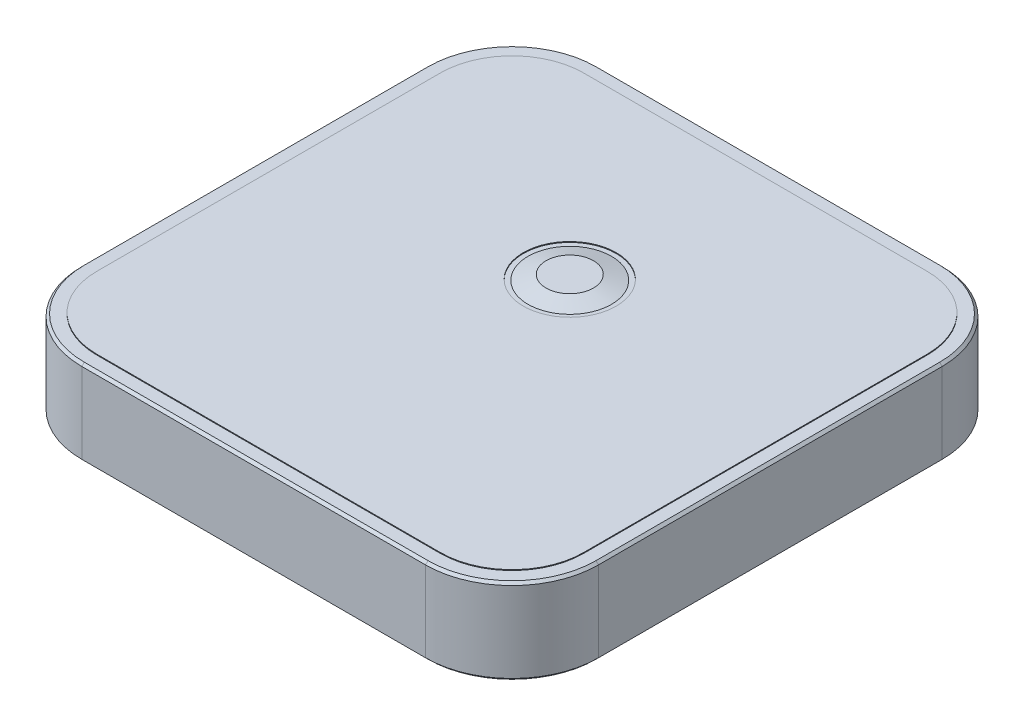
ISO-10303-21;
HEADER;
FILE_DESCRIPTION(('STEP AP214'),'2;1');
FILE_NAME('part.step','',(''),(''),'','','');
FILE_SCHEMA(('AUTOMOTIVE_DESIGN { 1 0 10303 214 1 1 1 1 }'));
ENDSEC;
DATA;
#1=APPLICATION_CONTEXT('core data for automotive mechanical design processes');
#2=APPLICATION_PROTOCOL_DEFINITION('international standard','automotive_design',2000,#1);
#3=PRODUCT_CONTEXT('',#1,'mechanical');
#4=PRODUCT('Part','Part','',(#3));
#5=PRODUCT_RELATED_PRODUCT_CATEGORY('part','',(#4));
#6=PRODUCT_DEFINITION_FORMATION('','',#4);
#7=PRODUCT_DEFINITION_CONTEXT('part definition',#1,'design');
#8=PRODUCT_DEFINITION('design','',#6,#7);
#9=PRODUCT_DEFINITION_SHAPE('','',#8);
#10=(LENGTH_UNIT() NAMED_UNIT(*) SI_UNIT(.MILLI.,.METRE.));
#11=(NAMED_UNIT(*) PLANE_ANGLE_UNIT() SI_UNIT($,.RADIAN.));
#12=(NAMED_UNIT(*) SI_UNIT($,.STERADIAN.) SOLID_ANGLE_UNIT());
#13=UNCERTAINTY_MEASURE_WITH_UNIT(LENGTH_MEASURE(1.E-05),#10,'distance_accuracy_value','');
#14=(GEOMETRIC_REPRESENTATION_CONTEXT(3) GLOBAL_UNCERTAINTY_ASSIGNED_CONTEXT((#13)) GLOBAL_UNIT_ASSIGNED_CONTEXT((#10,
#11,#12)) REPRESENTATION_CONTEXT('',''));
#15=CARTESIAN_POINT('',(0.,0.,0.));
#16=DIRECTION('',(0.,0.,1.));
#17=DIRECTION('',(1.,0.,0.));
#18=AXIS2_PLACEMENT_3D('',#15,#16,#17);
#19=CARTESIAN_POINT('',(12.52,4.39,-15.32));
#20=DIRECTION('',(0.,1.,0.));
#21=DIRECTION('',(0.,0.,1.));
#22=AXIS2_PLACEMENT_3D('',#19,#20,#21);
#23=PLANE('',#22);
#24=CARTESIAN_POINT('',(12.52,4.39000000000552,-15.32));
#25=DIRECTION('',(0.,-1.,0.));
#26=DIRECTION('',(0.,0.,-1.));
#27=AXIS2_PLACEMENT_3D('',#24,#25,#26);
#28=CIRCLE('',#27,1.14892929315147);
#29=CARTESIAN_POINT('',(12.52,4.39000000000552,-16.4689292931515));
#30=VERTEX_POINT('',#29);
#31=EDGE_CURVE('E20',#30,#30,#28,.T.);
#32=ORIENTED_EDGE('',*,*,#31,.F.);
#33=EDGE_LOOP('',(#32));
#34=FACE_BOUND('',#33,.T.);
#35=ADVANCED_FACE('F17',(#34),#23,.T.);
#36=CARTESIAN_POINT('',(12.52,4.14000000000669,-15.32));
#37=DIRECTION('',(0.,-1.,0.));
#38=DIRECTION('',(0.,0.,-1.));
#39=AXIS2_PLACEMENT_3D('',#36,#37,#38);
#40=CONICAL_SURFACE('',#39,2.02078290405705,1.29154364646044);
#41=ORIENTED_EDGE('',*,*,#31,.T.);
#42=EDGE_LOOP('',(#41));
#43=FACE_BOUND('',#42,.T.);
#44=CARTESIAN_POINT('',(12.52,4.13999999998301,-15.32));
#45=DIRECTION('',(0.,-1.,0.));
#46=DIRECTION('',(0.,0.,-1.));
#47=AXIS2_PLACEMENT_3D('',#44,#45,#46);
#48=CIRCLE('',#47,2.02078290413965);
#49=CARTESIAN_POINT('',(12.52,4.13999999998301,-17.3407829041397));
#50=VERTEX_POINT('',#49);
#51=EDGE_CURVE('E164',#50,#50,#48,.F.);
#52=ORIENTED_EDGE('',*,*,#51,.T.);
#53=EDGE_LOOP('',(#52));
#54=FACE_BOUND('',#53,.T.);
#55=ADVANCED_FACE('F171',(#43,#54),#40,.T.);
#56=CARTESIAN_POINT('',(0.,4.14,0.));
#57=DIRECTION('',(0.,-1.,0.));
#58=DIRECTION('',(0.,0.,-1.));
#59=AXIS2_PLACEMENT_3D('',#56,#57,#58);
#60=PLANE('',#59);
#61=ORIENTED_EDGE('',*,*,#51,.F.);
#62=EDGE_LOOP('',(#61));
#63=FACE_BOUND('',#62,.T.);
#64=CARTESIAN_POINT('',(12.52,4.14,-15.32));
#65=DIRECTION('',(0.,-1.,0.));
#66=DIRECTION('',(0.,0.,-1.));
#67=AXIS2_PLACEMENT_3D('',#64,#65,#66);
#68=CIRCLE('',#67,2.25);
#69=CARTESIAN_POINT('',(12.52,4.14,-17.57));
#70=VERTEX_POINT('',#69);
#71=EDGE_CURVE('E162',#70,#70,#68,.F.);
#72=ORIENTED_EDGE('',*,*,#71,.T.);
#73=EDGE_LOOP('',(#72));
#74=FACE_BOUND('',#73,.T.);
#75=ADVANCED_FACE('F178',(#63,#74),#60,.F.);
#76=CARTESIAN_POINT('',(12.52,4.18,-15.32));
#77=DIRECTION('',(0.,-1.,0.));
#78=DIRECTION('',(0.,0.,-1.));
#79=AXIS2_PLACEMENT_3D('',#76,#77,#78);
#80=CYLINDRICAL_SURFACE('',#79,2.25);
#81=ORIENTED_EDGE('',*,*,#71,.F.);
#82=EDGE_LOOP('',(#81));
#83=FACE_BOUND('',#82,.T.);
#84=CARTESIAN_POINT('',(12.52,4.18,-15.32));
#85=DIRECTION('',(0.,-1.,0.));
#86=DIRECTION('',(0.,0.,-1.));
#87=AXIS2_PLACEMENT_3D('',#84,#85,#86);
#88=CIRCLE('',#87,2.25);
#89=CARTESIAN_POINT('',(12.52,4.18,-17.57));
#90=VERTEX_POINT('',#89);
#91=EDGE_CURVE('E141',#90,#90,#88,.T.);
#92=ORIENTED_EDGE('',*,*,#91,.F.);
#93=EDGE_LOOP('',(#92));
#94=FACE_BOUND('',#93,.T.);
#95=ADVANCED_FACE('F316',(#83,#94),#80,.F.);
#96=CARTESIAN_POINT('',(4.19,4.18,-20.85));
#97=DIRECTION('',(0.,1.,0.));
#98=DIRECTION('',(0.,0.,1.));
#99=AXIS2_PLACEMENT_3D('',#96,#97,#98);
#100=PLANE('',#99);
#101=ORIENTED_EDGE('',*,*,#91,.T.);
#102=EDGE_LOOP('',(#101));
#103=FACE_BOUND('',#102,.T.);
#104=CARTESIAN_POINT('',(20.85,4.18,-20.85));
#105=DIRECTION('',(0.,-1.,0.));
#106=DIRECTION('',(0.,0.,-1.));
#107=AXIS2_PLACEMENT_3D('',#104,#105,#106);
#108=CIRCLE('',#107,3.47);
#109=CARTESIAN_POINT('',(20.85,4.18,-24.32));
#110=VERTEX_POINT('',#109);
#111=CARTESIAN_POINT('',(24.32,4.18,-20.85));
#112=VERTEX_POINT('',#111);
#113=EDGE_CURVE('E679',#110,#112,#108,.T.);
#114=ORIENTED_EDGE('',*,*,#113,.F.);
#115=DIRECTION('',(1.,0.,0.));
#116=VECTOR('',#115,1.);
#117=CARTESIAN_POINT('',(4.19,4.18,-24.32));
#118=LINE('',#117,#116);
#119=CARTESIAN_POINT('',(4.19,4.18,-24.32));
#120=VERTEX_POINT('',#119);
#121=EDGE_CURVE('E690',#110,#120,#118,.F.);
#122=ORIENTED_EDGE('',*,*,#121,.T.);
#123=CARTESIAN_POINT('',(4.19,4.18,-20.85));
#124=DIRECTION('',(0.,-1.,0.));
#125=DIRECTION('',(0.,0.,-1.));
#126=AXIS2_PLACEMENT_3D('',#123,#124,#125);
#127=CIRCLE('',#126,3.47);
#128=CARTESIAN_POINT('',(0.719999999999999,4.18,-20.85));
#129=VERTEX_POINT('',#128);
#130=EDGE_CURVE('E138',#129,#120,#127,.T.);
#131=ORIENTED_EDGE('',*,*,#130,.F.);
#132=DIRECTION('',(0.,0.,-1.));
#133=VECTOR('',#132,1.);
#134=CARTESIAN_POINT('',(0.719999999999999,4.18,-4.19));
#135=LINE('',#134,#133);
#136=CARTESIAN_POINT('',(0.719999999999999,4.18,-4.19));
#137=VERTEX_POINT('',#136);
#138=EDGE_CURVE('E134',#129,#137,#135,.F.);
#139=ORIENTED_EDGE('',*,*,#138,.T.);
#140=CARTESIAN_POINT('',(4.19,4.18,-4.19));
#141=DIRECTION('',(0.,-1.,0.));
#142=DIRECTION('',(0.,0.,-1.));
#143=AXIS2_PLACEMENT_3D('',#140,#141,#142);
#144=CIRCLE('',#143,3.47);
#145=CARTESIAN_POINT('',(4.19,4.18,-0.719999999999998));
#146=VERTEX_POINT('',#145);
#147=EDGE_CURVE('E131',#146,#137,#144,.T.);
#148=ORIENTED_EDGE('',*,*,#147,.F.);
#149=DIRECTION('',(-1.,0.,0.));
#150=VECTOR('',#149,1.);
#151=CARTESIAN_POINT('',(20.85,4.18,-0.719999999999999));
#152=LINE('',#151,#150);
#153=CARTESIAN_POINT('',(20.85,4.18,-0.719999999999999));
#154=VERTEX_POINT('',#153);
#155=EDGE_CURVE('E619',#146,#154,#152,.F.);
#156=ORIENTED_EDGE('',*,*,#155,.T.);
#157=CARTESIAN_POINT('',(20.85,4.18,-4.19));
#158=DIRECTION('',(0.,-1.,0.));
#159=DIRECTION('',(0.,0.,-1.));
#160=AXIS2_PLACEMENT_3D('',#157,#158,#159);
#161=CIRCLE('',#160,3.47);
#162=CARTESIAN_POINT('',(24.32,4.18,-4.19));
#163=VERTEX_POINT('',#162);
#164=EDGE_CURVE('E158',#163,#154,#161,.T.);
#165=ORIENTED_EDGE('',*,*,#164,.F.);
#166=DIRECTION('',(0.,0.,1.));
#167=VECTOR('',#166,1.);
#168=CARTESIAN_POINT('',(24.32,4.18,-20.85));
#169=LINE('',#168,#167);
#170=EDGE_CURVE('E632',#163,#112,#169,.F.);
#171=ORIENTED_EDGE('',*,*,#170,.T.);
#172=EDGE_LOOP('',(#114,#122,#131,#139,#148,#156,#165,#171));
#173=FACE_BOUND('',#172,.T.);
#174=ADVANCED_FACE('F136',(#103,#173),#100,.T.);
#175=CARTESIAN_POINT('',(0.719999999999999,4.18,-4.19));
#176=DIRECTION('',(1.,0.,0.));
#177=DIRECTION('',(0.,0.,-1.));
#178=AXIS2_PLACEMENT_3D('',#175,#176,#177);
#179=PLANE('',#178);
#180=DIRECTION('',(0.,-1.,0.));
#181=VECTOR('',#180,1.);
#182=CARTESIAN_POINT('',(0.72,4.18,-4.19));
#183=LINE('',#182,#181);
#184=CARTESIAN_POINT('',(0.719999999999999,4.14,-4.19));
#185=VERTEX_POINT('',#184);
#186=EDGE_CURVE('E144',#137,#185,#183,.T.);
#187=ORIENTED_EDGE('',*,*,#186,.F.);
#188=ORIENTED_EDGE('',*,*,#138,.F.);
#189=DIRECTION('',(0.,-1.,0.));
#190=VECTOR('',#189,1.);
#191=CARTESIAN_POINT('',(0.72,4.18,-20.85));
#192=LINE('',#191,#190);
#193=CARTESIAN_POINT('',(0.719999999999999,4.14,-20.85));
#194=VERTEX_POINT('',#193);
#195=EDGE_CURVE('E678',#194,#129,#192,.F.);
#196=ORIENTED_EDGE('',*,*,#195,.F.);
#197=DIRECTION('',(0.,0.,-1.));
#198=VECTOR('',#197,1.);
#199=CARTESIAN_POINT('',(0.719999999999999,4.14,0.));
#200=LINE('',#199,#198);
#201=EDGE_CURVE('E147',#194,#185,#200,.F.);
#202=ORIENTED_EDGE('',*,*,#201,.T.);
#203=EDGE_LOOP('',(#187,#188,#196,#202));
#204=FACE_BOUND('',#203,.T.);
#205=ADVANCED_FACE('F145',(#204),#179,.F.);
#206=CARTESIAN_POINT('',(4.19,4.18,-4.19));
#207=DIRECTION('',(0.,-1.,0.));
#208=DIRECTION('',(0.,0.,-1.));
#209=AXIS2_PLACEMENT_3D('',#206,#207,#208);
#210=CYLINDRICAL_SURFACE('',#209,3.47);
#211=ORIENTED_EDGE('',*,*,#147,.T.);
#212=ORIENTED_EDGE('',*,*,#186,.T.);
#213=CARTESIAN_POINT('',(4.19,4.14,-4.19));
#214=DIRECTION('',(0.,-1.,0.));
#215=DIRECTION('',(0.,0.,-1.));
#216=AXIS2_PLACEMENT_3D('',#213,#214,#215);
#217=CIRCLE('',#216,3.47);
#218=CARTESIAN_POINT('',(4.19,4.14,-0.719999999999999));
#219=VERTEX_POINT('',#218);
#220=EDGE_CURVE('E675',#185,#219,#217,.F.);
#221=ORIENTED_EDGE('',*,*,#220,.T.);
#222=DIRECTION('',(0.,1.,0.));
#223=VECTOR('',#222,1.);
#224=CARTESIAN_POINT('',(4.19,4.18,-0.719999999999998));
#225=LINE('',#224,#223);
#226=EDGE_CURVE('E150',#219,#146,#225,.T.);
#227=ORIENTED_EDGE('',*,*,#226,.T.);
#228=EDGE_LOOP('',(#211,#212,#221,#227));
#229=FACE_BOUND('',#228,.T.);
#230=ADVANCED_FACE('F152',(#229),#210,.T.);
#231=CARTESIAN_POINT('',(20.85,4.18,-0.719999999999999));
#232=DIRECTION('',(0.,0.,-1.));
#233=DIRECTION('',(-1.,0.,0.));
#234=AXIS2_PLACEMENT_3D('',#231,#232,#233);
#235=PLANE('',#234);
#236=DIRECTION('',(0.,-1.,0.));
#237=VECTOR('',#236,1.);
#238=CARTESIAN_POINT('',(20.85,4.18,-0.72));
#239=LINE('',#238,#237);
#240=CARTESIAN_POINT('',(20.85,4.14,-0.719999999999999));
#241=VERTEX_POINT('',#240);
#242=EDGE_CURVE('E617',#154,#241,#239,.T.);
#243=ORIENTED_EDGE('',*,*,#242,.F.);
#244=ORIENTED_EDGE('',*,*,#155,.F.);
#245=ORIENTED_EDGE('',*,*,#226,.F.);
#246=DIRECTION('',(1.,0.,0.));
#247=VECTOR('',#246,1.);
#248=CARTESIAN_POINT('',(0.,4.14,-0.719999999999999));
#249=LINE('',#248,#247);
#250=EDGE_CURVE('E621',#219,#241,#249,.T.);
#251=ORIENTED_EDGE('',*,*,#250,.T.);
#252=EDGE_LOOP('',(#243,#244,#245,#251));
#253=FACE_BOUND('',#252,.T.);
#254=ADVANCED_FACE('F305',(#253),#235,.F.);
#255=CARTESIAN_POINT('',(20.85,4.18,-4.19));
#256=DIRECTION('',(0.,-1.,0.));
#257=DIRECTION('',(0.,0.,-1.));
#258=AXIS2_PLACEMENT_3D('',#255,#256,#257);
#259=CYLINDRICAL_SURFACE('',#258,3.47);
#260=ORIENTED_EDGE('',*,*,#164,.T.);
#261=ORIENTED_EDGE('',*,*,#242,.T.);
#262=CARTESIAN_POINT('',(20.85,4.14,-4.19));
#263=DIRECTION('',(0.,-1.,0.));
#264=DIRECTION('',(0.,0.,-1.));
#265=AXIS2_PLACEMENT_3D('',#262,#263,#264);
#266=CIRCLE('',#265,3.47);
#267=CARTESIAN_POINT('',(24.32,4.14,-4.19));
#268=VERTEX_POINT('',#267);
#269=EDGE_CURVE('E673',#241,#268,#266,.F.);
#270=ORIENTED_EDGE('',*,*,#269,.T.);
#271=DIRECTION('',(0.,1.,0.));
#272=VECTOR('',#271,1.);
#273=CARTESIAN_POINT('',(24.32,4.18,-4.19));
#274=LINE('',#273,#272);
#275=EDGE_CURVE('E623',#268,#163,#274,.T.);
#276=ORIENTED_EDGE('',*,*,#275,.T.);
#277=EDGE_LOOP('',(#260,#261,#270,#276));
#278=FACE_BOUND('',#277,.T.);
#279=ADVANCED_FACE('F301',(#278),#259,.T.);
#280=CARTESIAN_POINT('',(24.32,4.18,-20.85));
#281=DIRECTION('',(-1.,0.,0.));
#282=DIRECTION('',(0.,0.,1.));
#283=AXIS2_PLACEMENT_3D('',#280,#281,#282);
#284=PLANE('',#283);
#285=DIRECTION('',(0.,-1.,0.));
#286=VECTOR('',#285,1.);
#287=CARTESIAN_POINT('',(24.32,4.18,-20.85));
#288=LINE('',#287,#286);
#289=CARTESIAN_POINT('',(24.32,4.14,-20.85));
#290=VERTEX_POINT('',#289);
#291=EDGE_CURVE('E681',#112,#290,#288,.T.);
#292=ORIENTED_EDGE('',*,*,#291,.F.);
#293=ORIENTED_EDGE('',*,*,#170,.F.);
#294=ORIENTED_EDGE('',*,*,#275,.F.);
#295=DIRECTION('',(0.,0.,-1.));
#296=VECTOR('',#295,1.);
#297=CARTESIAN_POINT('',(24.32,4.14,0.));
#298=LINE('',#297,#296);
#299=EDGE_CURVE('E672',#268,#290,#298,.T.);
#300=ORIENTED_EDGE('',*,*,#299,.T.);
#301=EDGE_LOOP('',(#292,#293,#294,#300));
#302=FACE_BOUND('',#301,.T.);
#303=ADVANCED_FACE('F297',(#302),#284,.F.);
#304=CARTESIAN_POINT('',(20.85,4.18,-20.85));
#305=DIRECTION('',(0.,-1.,0.));
#306=DIRECTION('',(0.,0.,-1.));
#307=AXIS2_PLACEMENT_3D('',#304,#305,#306);
#308=CYLINDRICAL_SURFACE('',#307,3.47);
#309=ORIENTED_EDGE('',*,*,#113,.T.);
#310=ORIENTED_EDGE('',*,*,#291,.T.);
#311=CARTESIAN_POINT('',(20.85,4.14,-20.85));
#312=DIRECTION('',(0.,-1.,0.));
#313=DIRECTION('',(0.,0.,-1.));
#314=AXIS2_PLACEMENT_3D('',#311,#312,#313);
#315=CIRCLE('',#314,3.47);
#316=CARTESIAN_POINT('',(20.85,4.14,-24.32));
#317=VERTEX_POINT('',#316);
#318=EDGE_CURVE('E670',#290,#317,#315,.F.);
#319=ORIENTED_EDGE('',*,*,#318,.T.);
#320=DIRECTION('',(0.,1.,0.));
#321=VECTOR('',#320,1.);
#322=CARTESIAN_POINT('',(20.85,4.18,-24.32));
#323=LINE('',#322,#321);
#324=EDGE_CURVE('E684',#317,#110,#323,.T.);
#325=ORIENTED_EDGE('',*,*,#324,.T.);
#326=EDGE_LOOP('',(#309,#310,#319,#325));
#327=FACE_BOUND('',#326,.T.);
#328=ADVANCED_FACE('F293',(#327),#308,.T.);
#329=CARTESIAN_POINT('',(4.19,4.18,-24.32));
#330=DIRECTION('',(0.,0.,1.));
#331=DIRECTION('',(1.,0.,0.));
#332=AXIS2_PLACEMENT_3D('',#329,#330,#331);
#333=PLANE('',#332);
#334=DIRECTION('',(0.,-1.,0.));
#335=VECTOR('',#334,1.);
#336=CARTESIAN_POINT('',(4.19,4.18,-24.32));
#337=LINE('',#336,#335);
#338=CARTESIAN_POINT('',(4.19,4.14,-24.32));
#339=VERTEX_POINT('',#338);
#340=EDGE_CURVE('E677',#120,#339,#337,.T.);
#341=ORIENTED_EDGE('',*,*,#340,.F.);
#342=ORIENTED_EDGE('',*,*,#121,.F.);
#343=ORIENTED_EDGE('',*,*,#324,.F.);
#344=DIRECTION('',(1.,0.,0.));
#345=VECTOR('',#344,1.);
#346=CARTESIAN_POINT('',(0.,4.14,-24.32));
#347=LINE('',#346,#345);
#348=EDGE_CURVE('E669',#317,#339,#347,.F.);
#349=ORIENTED_EDGE('',*,*,#348,.T.);
#350=EDGE_LOOP('',(#341,#342,#343,#349));
#351=FACE_BOUND('',#350,.T.);
#352=ADVANCED_FACE('F289',(#351),#333,.F.);
#353=CARTESIAN_POINT('',(4.19,4.18,-20.85));
#354=DIRECTION('',(0.,-1.,0.));
#355=DIRECTION('',(0.,0.,-1.));
#356=AXIS2_PLACEMENT_3D('',#353,#354,#355);
#357=CYLINDRICAL_SURFACE('',#356,3.47);
#358=ORIENTED_EDGE('',*,*,#130,.T.);
#359=ORIENTED_EDGE('',*,*,#340,.T.);
#360=CARTESIAN_POINT('',(4.19,4.14,-20.85));
#361=DIRECTION('',(0.,-1.,0.));
#362=DIRECTION('',(0.,0.,-1.));
#363=AXIS2_PLACEMENT_3D('',#360,#361,#362);
#364=CIRCLE('',#363,3.47);
#365=EDGE_CURVE('E666',#339,#194,#364,.F.);
#366=ORIENTED_EDGE('',*,*,#365,.T.);
#367=ORIENTED_EDGE('',*,*,#195,.T.);
#368=EDGE_LOOP('',(#358,#359,#366,#367));
#369=FACE_BOUND('',#368,.T.);
#370=ADVANCED_FACE('F285',(#369),#357,.T.);
#371=CARTESIAN_POINT('',(0.,4.14,0.));
#372=DIRECTION('',(0.,-1.,0.));
#373=DIRECTION('',(0.,0.,-1.));
#374=AXIS2_PLACEMENT_3D('',#371,#372,#373);
#375=PLANE('',#374);
#376=ORIENTED_EDGE('',*,*,#348,.F.);
#377=ORIENTED_EDGE('',*,*,#318,.F.);
#378=ORIENTED_EDGE('',*,*,#299,.F.);
#379=ORIENTED_EDGE('',*,*,#269,.F.);
#380=ORIENTED_EDGE('',*,*,#250,.F.);
#381=ORIENTED_EDGE('',*,*,#220,.F.);
#382=ORIENTED_EDGE('',*,*,#201,.F.);
#383=ORIENTED_EDGE('',*,*,#365,.F.);
#384=EDGE_LOOP('',(#376,#377,#378,#379,#380,#381,#382,#383));
#385=FACE_BOUND('',#384,.T.);
#386=DIRECTION('',(1.,0.,0.));
#387=VECTOR('',#386,1.);
#388=CARTESIAN_POINT('',(0.,4.14,-0.119999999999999));
#389=LINE('',#388,#387);
#390=CARTESIAN_POINT('',(4.19,4.14000000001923,-0.120000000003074));
#391=VERTEX_POINT('',#390);
#392=CARTESIAN_POINT('',(20.85,4.14000000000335,-0.120000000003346));
#393=VERTEX_POINT('',#392);
#394=EDGE_CURVE('E665',#391,#393,#389,.T.);
#395=ORIENTED_EDGE('',*,*,#394,.T.);
#396=CARTESIAN_POINT('',(20.85,4.14000000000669,-4.19));
#397=DIRECTION('',(0.,-1.,0.));
#398=DIRECTION('',(0.,0.,-1.));
#399=AXIS2_PLACEMENT_3D('',#396,#397,#398);
#400=CIRCLE('',#399,4.0699999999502);
#401=CARTESIAN_POINT('',(24.9199999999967,4.14000000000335,-4.19));
#402=VERTEX_POINT('',#401);
#403=EDGE_CURVE('E662',#402,#393,#400,.T.);
#404=ORIENTED_EDGE('',*,*,#403,.F.);
#405=DIRECTION('',(0.,0.,1.));
#406=VECTOR('',#405,1.);
#407=CARTESIAN_POINT('',(24.92,4.14,0.));
#408=LINE('',#407,#406);
#409=CARTESIAN_POINT('',(24.9199999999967,4.14000000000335,-20.85));
#410=VERTEX_POINT('',#409);
#411=EDGE_CURVE('E708',#402,#410,#408,.F.);
#412=ORIENTED_EDGE('',*,*,#411,.T.);
#413=CARTESIAN_POINT('',(20.85,4.14000000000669,-20.85));
#414=DIRECTION('',(0.,-1.,0.));
#415=DIRECTION('',(0.,0.,-1.));
#416=AXIS2_PLACEMENT_3D('',#413,#414,#415);
#417=CIRCLE('',#416,4.06999999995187);
#418=CARTESIAN_POINT('',(20.85,4.14000000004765,-24.9199999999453));
#419=VERTEX_POINT('',#418);
#420=EDGE_CURVE('E647',#419,#410,#417,.T.);
#421=ORIENTED_EDGE('',*,*,#420,.F.);
#422=DIRECTION('',(1.,0.,0.));
#423=VECTOR('',#422,1.);
#424=CARTESIAN_POINT('',(0.,4.14,-24.92));
#425=LINE('',#424,#423);
#426=CARTESIAN_POINT('',(4.19,4.13999999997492,-24.9200000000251));
#427=VERTEX_POINT('',#426);
#428=EDGE_CURVE('E655',#419,#427,#425,.F.);
#429=ORIENTED_EDGE('',*,*,#428,.T.);
#430=CARTESIAN_POINT('',(4.19,4.13999999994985,-20.85));
#431=DIRECTION('',(0.,-1.,0.));
#432=DIRECTION('',(0.,0.,-1.));
#433=AXIS2_PLACEMENT_3D('',#430,#431,#432);
#434=CIRCLE('',#433,4.07000000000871);
#435=CARTESIAN_POINT('',(0.120000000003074,4.1399999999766,-20.85));
#436=VERTEX_POINT('',#435);
#437=EDGE_CURVE('E652',#436,#427,#434,.T.);
#438=ORIENTED_EDGE('',*,*,#437,.F.);
#439=DIRECTION('',(0.,0.,1.));
#440=VECTOR('',#439,1.);
#441=CARTESIAN_POINT('',(0.119999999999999,4.14,0.));
#442=LINE('',#441,#440);
#443=CARTESIAN_POINT('',(0.120000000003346,4.14000000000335,-4.19));
#444=VERTEX_POINT('',#443);
#445=EDGE_CURVE('E660',#436,#444,#442,.T.);
#446=ORIENTED_EDGE('',*,*,#445,.T.);
#447=CARTESIAN_POINT('',(4.19,4.14000000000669,-4.19));
#448=DIRECTION('',(0.,-1.,0.));
#449=DIRECTION('',(0.,0.,-1.));
#450=AXIS2_PLACEMENT_3D('',#447,#448,#449);
#451=CIRCLE('',#450,4.07000000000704);
#452=EDGE_CURVE('E657',#391,#444,#451,.T.);
#453=ORIENTED_EDGE('',*,*,#452,.F.);
#454=EDGE_LOOP('',(#395,#404,#412,#421,#429,#438,#446,#453));
#455=FACE_BOUND('',#454,.T.);
#456=ADVANCED_FACE('F281',(#385,#455),#375,.F.);
#457=CARTESIAN_POINT('',(20.85,4.02000000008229,-4.19));
#458=DIRECTION('',(0.,-1.,0.));
#459=DIRECTION('',(0.,0.,-1.));
#460=AXIS2_PLACEMENT_3D('',#457,#458,#459);
#461=CONICAL_SURFACE('',#460,4.18999999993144,0.785398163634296);
#462=DIRECTION('',(0.,0.707106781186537,-0.707106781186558));
#463=VECTOR('',#462,1.);
#464=CARTESIAN_POINT('',(20.85,4.14,-0.119999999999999));
#465=LINE('',#464,#463);
#466=CARTESIAN_POINT('',(20.85,4.02,0.));
#467=VERTEX_POINT('',#466);
#468=EDGE_CURVE('E699',#393,#467,#465,.F.);
#469=ORIENTED_EDGE('',*,*,#468,.T.);
#470=CARTESIAN_POINT('',(20.85,4.02,-4.19));
#471=DIRECTION('',(0.,-1.,0.));
#472=DIRECTION('',(0.,0.,-1.));
#473=AXIS2_PLACEMENT_3D('',#470,#471,#472);
#474=CIRCLE('',#473,4.19);
#475=CARTESIAN_POINT('',(25.04,4.02,-4.19));
#476=VERTEX_POINT('',#475);
#477=EDGE_CURVE('E721',#476,#467,#474,.T.);
#478=ORIENTED_EDGE('',*,*,#477,.F.);
#479=DIRECTION('',(0.707106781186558,-0.707106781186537,0.));
#480=VECTOR('',#479,1.);
#481=CARTESIAN_POINT('',(24.92,4.14,-4.19));
#482=LINE('',#481,#480);
#483=EDGE_CURVE('E650',#476,#402,#482,.F.);
#484=ORIENTED_EDGE('',*,*,#483,.T.);
#485=ORIENTED_EDGE('',*,*,#403,.T.);
#486=EDGE_LOOP('',(#469,#478,#484,#485));
#487=FACE_BOUND('',#486,.T.);
#488=ADVANCED_FACE('F277',(#487),#461,.T.);
#489=CARTESIAN_POINT('',(0.,4.14,-0.119999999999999));
#490=DIRECTION('',(0.,-0.707106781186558,-0.707106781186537));
#491=DIRECTION('',(0.,0.707106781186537,-0.707106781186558));
#492=AXIS2_PLACEMENT_3D('',#489,#490,#491);
#493=PLANE('',#492);
#494=DIRECTION('',(-1.,0.,0.));
#495=VECTOR('',#494,1.);
#496=CARTESIAN_POINT('',(0.,4.02,0.));
#497=LINE('',#496,#495);
#498=CARTESIAN_POINT('',(4.19,4.02000000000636,-1.4210854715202E-11));
#499=VERTEX_POINT('',#498);
#500=EDGE_CURVE('E717',#499,#467,#497,.F.);
#501=ORIENTED_EDGE('',*,*,#500,.T.);
#502=ORIENTED_EDGE('',*,*,#468,.F.);
#503=ORIENTED_EDGE('',*,*,#394,.F.);
#504=DIRECTION('',(0.,0.707106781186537,-0.707106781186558));
#505=VECTOR('',#504,1.);
#506=CARTESIAN_POINT('',(4.19000000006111,-498987.599999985,498991.62));
#507=LINE('',#506,#505);
#508=EDGE_CURVE('E661',#499,#391,#507,.T.);
#509=ORIENTED_EDGE('',*,*,#508,.F.);
#510=EDGE_LOOP('',(#501,#502,#503,#509));
#511=FACE_BOUND('',#510,.T.);
#512=ADVANCED_FACE('F273',(#511),#493,.F.);
#513=CARTESIAN_POINT('',(4.19,4.02000000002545,-4.19));
#514=DIRECTION('',(0.,-1.,0.));
#515=DIRECTION('',(0.,0.,-1.));
#516=AXIS2_PLACEMENT_3D('',#513,#514,#515);
#517=CONICAL_SURFACE('',#516,4.18999999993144,0.785398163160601);
#518=ORIENTED_EDGE('',*,*,#508,.T.);
#519=ORIENTED_EDGE('',*,*,#452,.T.);
#520=DIRECTION('',(0.707106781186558,0.707106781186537,0.));
#521=VECTOR('',#520,1.);
#522=CARTESIAN_POINT('',(0.119999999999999,4.14,-4.19));
#523=LINE('',#522,#521);
#524=CARTESIAN_POINT('',(0.,4.02,-4.19));
#525=VERTEX_POINT('',#524);
#526=EDGE_CURVE('E701',#444,#525,#523,.F.);
#527=ORIENTED_EDGE('',*,*,#526,.T.);
#528=CARTESIAN_POINT('',(4.19,4.02,-4.19));
#529=DIRECTION('',(0.,-1.,0.));
#530=DIRECTION('',(0.,0.,-1.));
#531=AXIS2_PLACEMENT_3D('',#528,#529,#530);
#532=CIRCLE('',#531,4.19);
#533=EDGE_CURVE('E732',#499,#525,#532,.T.);
#534=ORIENTED_EDGE('',*,*,#533,.F.);
#535=EDGE_LOOP('',(#518,#519,#527,#534));
#536=FACE_BOUND('',#535,.T.);
#537=ADVANCED_FACE('F269',(#536),#517,.T.);
#538=CARTESIAN_POINT('',(0.119999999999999,4.14,0.));
#539=DIRECTION('',(0.707106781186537,-0.707106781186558,0.));
#540=DIRECTION('',(0.707106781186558,0.707106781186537,0.));
#541=AXIS2_PLACEMENT_3D('',#538,#539,#540);
#542=PLANE('',#541);
#543=DIRECTION('',(0.,0.,-1.));
#544=VECTOR('',#543,1.);
#545=CARTESIAN_POINT('',(0.,4.02,0.));
#546=LINE('',#545,#544);
#547=CARTESIAN_POINT('',(2.8421709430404E-11,4.02000000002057,-20.85));
#548=VERTEX_POINT('',#547);
#549=EDGE_CURVE('E735',#548,#525,#546,.F.);
#550=ORIENTED_EDGE('',*,*,#549,.T.);
#551=ORIENTED_EDGE('',*,*,#526,.F.);
#552=ORIENTED_EDGE('',*,*,#445,.F.);
#553=DIRECTION('',(0.707106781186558,0.707106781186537,0.));
#554=VECTOR('',#553,1.);
#555=CARTESIAN_POINT('',(-498974.96,-498970.939999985,-20.8499999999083));
#556=LINE('',#555,#554);
#557=EDGE_CURVE('E656',#548,#436,#556,.T.);
#558=ORIENTED_EDGE('',*,*,#557,.F.);
#559=EDGE_LOOP('',(#550,#551,#552,#558));
#560=FACE_BOUND('',#559,.T.);
#561=ADVANCED_FACE('F265',(#560),#542,.F.);
#562=CARTESIAN_POINT('',(4.19,4.02000000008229,-20.85));
#563=DIRECTION('',(0.,-1.,0.));
#564=DIRECTION('',(0.,0.,-1.));
#565=AXIS2_PLACEMENT_3D('',#562,#563,#564);
#566=CONICAL_SURFACE('',#565,4.18999999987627,0.785398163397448);
#567=ORIENTED_EDGE('',*,*,#557,.T.);
#568=ORIENTED_EDGE('',*,*,#437,.T.);
#569=DIRECTION('',(0.,-0.707106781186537,-0.707106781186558));
#570=VECTOR('',#569,1.);
#571=CARTESIAN_POINT('',(4.19,4.14,-24.92));
#572=LINE('',#571,#570);
#573=CARTESIAN_POINT('',(4.19,4.02,-25.04));
#574=VERTEX_POINT('',#573);
#575=EDGE_CURVE('E703',#427,#574,#572,.T.);
#576=ORIENTED_EDGE('',*,*,#575,.T.);
#577=CARTESIAN_POINT('',(4.19,4.02,-20.85));
#578=DIRECTION('',(0.,-1.,0.));
#579=DIRECTION('',(0.,0.,-1.));
#580=AXIS2_PLACEMENT_3D('',#577,#578,#579);
#581=CIRCLE('',#580,4.19);
#582=EDGE_CURVE('E752',#548,#574,#581,.T.);
#583=ORIENTED_EDGE('',*,*,#582,.F.);
#584=EDGE_LOOP('',(#567,#568,#576,#583));
#585=FACE_BOUND('',#584,.T.);
#586=ADVANCED_FACE('F261',(#585),#566,.T.);
#587=CARTESIAN_POINT('',(0.,4.14,-24.92));
#588=DIRECTION('',(0.,-0.707106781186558,0.707106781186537));
#589=DIRECTION('',(0.,-0.707106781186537,-0.707106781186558));
#590=AXIS2_PLACEMENT_3D('',#587,#588,#589);
#591=PLANE('',#590);
#592=DIRECTION('',(1.,0.,0.));
#593=VECTOR('',#592,1.);
#594=CARTESIAN_POINT('',(0.,4.02,-25.04));
#595=LINE('',#594,#593);
#596=CARTESIAN_POINT('',(20.85,4.02000000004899,-25.0399999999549));
#597=VERTEX_POINT('',#596);
#598=EDGE_CURVE('E755',#597,#574,#595,.F.);
#599=ORIENTED_EDGE('',*,*,#598,.T.);
#600=ORIENTED_EDGE('',*,*,#575,.F.);
#601=ORIENTED_EDGE('',*,*,#428,.F.);
#602=DIRECTION('',(0.,0.707106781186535,0.70710678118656));
#603=VECTOR('',#602,1.);
#604=CARTESIAN_POINT('',(20.85,-498970.939999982,-499000.));
#605=LINE('',#604,#603);
#606=EDGE_CURVE('E651',#597,#419,#605,.T.);
#607=ORIENTED_EDGE('',*,*,#606,.F.);
#608=EDGE_LOOP('',(#599,#600,#601,#607));
#609=FACE_BOUND('',#608,.T.);
#610=ADVANCED_FACE('F257',(#609),#591,.F.);
#611=CARTESIAN_POINT('',(20.85,4.02000000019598,-20.85));
#612=DIRECTION('',(0.,-1.,0.));
#613=DIRECTION('',(0.,0.,-1.));
#614=AXIS2_PLACEMENT_3D('',#611,#612,#613);
#615=CONICAL_SURFACE('',#614,4.18999999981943,0.785398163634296);
#616=DIRECTION('',(0.707106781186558,-0.707106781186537,0.));
#617=VECTOR('',#616,1.);
#618=CARTESIAN_POINT('',(24.92,4.14,-20.85));
#619=LINE('',#618,#617);
#620=CARTESIAN_POINT('',(25.04,4.02,-20.85));
#621=VERTEX_POINT('',#620);
#622=EDGE_CURVE('E710',#410,#621,#619,.T.);
#623=ORIENTED_EDGE('',*,*,#622,.T.);
#624=CARTESIAN_POINT('',(20.85,4.02,-20.85));
#625=DIRECTION('',(0.,-1.,0.));
#626=DIRECTION('',(0.,0.,-1.));
#627=AXIS2_PLACEMENT_3D('',#624,#625,#626);
#628=CIRCLE('',#627,4.19);
#629=EDGE_CURVE('E776',#597,#621,#628,.T.);
#630=ORIENTED_EDGE('',*,*,#629,.F.);
#631=ORIENTED_EDGE('',*,*,#606,.T.);
#632=ORIENTED_EDGE('',*,*,#420,.T.);
#633=EDGE_LOOP('',(#623,#630,#631,#632));
#634=FACE_BOUND('',#633,.T.);
#635=ADVANCED_FACE('F253',(#634),#615,.T.);
#636=CARTESIAN_POINT('',(24.92,4.14,0.));
#637=DIRECTION('',(-0.707106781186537,-0.707106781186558,0.));
#638=DIRECTION('',(0.707106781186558,-0.707106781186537,0.));
#639=AXIS2_PLACEMENT_3D('',#636,#637,#638);
#640=PLANE('',#639);
#641=ORIENTED_EDGE('',*,*,#411,.F.);
#642=ORIENTED_EDGE('',*,*,#483,.F.);
#643=DIRECTION('',(0.,0.,1.));
#644=VECTOR('',#643,1.);
#645=CARTESIAN_POINT('',(25.04,4.02,0.));
#646=LINE('',#645,#644);
#647=EDGE_CURVE('E779',#476,#621,#646,.F.);
#648=ORIENTED_EDGE('',*,*,#647,.T.);
#649=ORIENTED_EDGE('',*,*,#622,.F.);
#650=EDGE_LOOP('',(#641,#642,#648,#649));
#651=FACE_BOUND('',#650,.T.);
#652=ADVANCED_FACE('F249',(#651),#640,.F.);
#653=CARTESIAN_POINT('',(20.85,4.14,-4.19));
#654=DIRECTION('',(0.,-1.,0.));
#655=DIRECTION('',(0.,0.,-1.));
#656=AXIS2_PLACEMENT_3D('',#653,#654,#655);
#657=CYLINDRICAL_SURFACE('',#656,4.19);
#658=DIRECTION('',(0.,1.,0.));
#659=VECTOR('',#658,1.);
#660=CARTESIAN_POINT('',(25.04,4.14,-4.19));
#661=LINE('',#660,#659);
#662=CARTESIAN_POINT('',(25.0399999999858,0.119999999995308,-4.19));
#663=VERTEX_POINT('',#662);
#664=EDGE_CURVE('E853',#663,#476,#661,.T.);
#665=ORIENTED_EDGE('',*,*,#664,.T.);
#666=ORIENTED_EDGE('',*,*,#477,.T.);
#667=DIRECTION('',(0.,1.,0.));
#668=VECTOR('',#667,1.);
#669=CARTESIAN_POINT('',(20.85,4.14,0.));
#670=LINE('',#669,#668);
#671=CARTESIAN_POINT('',(20.85,0.119999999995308,-1.4210854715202E-11));
#672=VERTEX_POINT('',#671);
#673=EDGE_CURVE('E720',#467,#672,#670,.F.);
#674=ORIENTED_EDGE('',*,*,#673,.T.);
#675=CARTESIAN_POINT('',(20.85,0.119999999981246,-4.19));
#676=DIRECTION('',(0.,1.,0.));
#677=DIRECTION('',(0.,0.,1.));
#678=AXIS2_PLACEMENT_3D('',#675,#676,#677);
#679=CIRCLE('',#678,4.18999999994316);
#680=EDGE_CURVE('E858',#663,#672,#679,.F.);
#681=ORIENTED_EDGE('',*,*,#680,.F.);
#682=EDGE_LOOP('',(#665,#666,#674,#681));
#683=FACE_BOUND('',#682,.T.);
#684=ADVANCED_FACE('F245',(#683),#657,.T.);
#685=CARTESIAN_POINT('',(0.,4.14,0.));
#686=DIRECTION('',(0.,0.,-1.));
#687=DIRECTION('',(-1.,0.,0.));
#688=AXIS2_PLACEMENT_3D('',#685,#686,#687);
#689=PLANE('',#688);
#690=DIRECTION('',(1.,0.,0.));
#691=VECTOR('',#690,1.);
#692=CARTESIAN_POINT('',(0.,0.119999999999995,0.));
#693=LINE('',#692,#691);
#694=CARTESIAN_POINT('',(4.19,0.119999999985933,-2.8421709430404E-11));
#695=VERTEX_POINT('',#694);
#696=EDGE_CURVE('E796',#672,#695,#693,.F.);
#697=ORIENTED_EDGE('',*,*,#696,.F.);
#698=ORIENTED_EDGE('',*,*,#673,.F.);
#699=ORIENTED_EDGE('',*,*,#500,.F.);
#700=DIRECTION('',(0.,-1.,0.));
#701=VECTOR('',#700,1.);
#702=CARTESIAN_POINT('',(4.19,4.14,0.));
#703=LINE('',#702,#701);
#704=EDGE_CURVE('E736',#695,#499,#703,.F.);
#705=ORIENTED_EDGE('',*,*,#704,.F.);
#706=EDGE_LOOP('',(#697,#698,#699,#705));
#707=FACE_BOUND('',#706,.T.);
#708=ADVANCED_FACE('F241',(#707),#689,.F.);
#709=CARTESIAN_POINT('',(4.19,4.14,-4.19));
#710=DIRECTION('',(0.,-1.,0.));
#711=DIRECTION('',(0.,0.,-1.));
#712=AXIS2_PLACEMENT_3D('',#709,#710,#711);
#713=CYLINDRICAL_SURFACE('',#712,4.19);
#714=ORIENTED_EDGE('',*,*,#704,.T.);
#715=ORIENTED_EDGE('',*,*,#533,.T.);
#716=DIRECTION('',(0.,1.,0.));
#717=VECTOR('',#716,1.);
#718=CARTESIAN_POINT('',(0.,4.14,-4.19));
#719=LINE('',#718,#717);
#720=CARTESIAN_POINT('',(0.,0.120000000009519,-4.19));
#721=VERTEX_POINT('',#720);
#722=EDGE_CURVE('E741',#525,#721,#719,.F.);
#723=ORIENTED_EDGE('',*,*,#722,.T.);
#724=CARTESIAN_POINT('',(4.19,0.12000000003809,-4.19));
#725=DIRECTION('',(0.,1.,0.));
#726=DIRECTION('',(0.,0.,1.));
#727=AXIS2_PLACEMENT_3D('',#724,#725,#726);
#728=CIRCLE('',#727,4.19);
#729=EDGE_CURVE('E807',#695,#721,#728,.F.);
#730=ORIENTED_EDGE('',*,*,#729,.F.);
#731=EDGE_LOOP('',(#714,#715,#723,#730));
#732=FACE_BOUND('',#731,.T.);
#733=ADVANCED_FACE('F237',(#732),#713,.T.);
#734=CARTESIAN_POINT('',(0.,4.14,0.));
#735=DIRECTION('',(1.,0.,0.));
#736=DIRECTION('',(0.,0.,-1.));
#737=AXIS2_PLACEMENT_3D('',#734,#735,#736);
#738=PLANE('',#737);
#739=DIRECTION('',(0.,0.,1.));
#740=VECTOR('',#739,1.);
#741=CARTESIAN_POINT('',(0.,0.119999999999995,0.));
#742=LINE('',#741,#740);
#743=CARTESIAN_POINT('',(2.88399946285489E-11,0.119999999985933,-20.85));
#744=VERTEX_POINT('',#743);
#745=EDGE_CURVE('E817',#721,#744,#742,.F.);
#746=ORIENTED_EDGE('',*,*,#745,.F.);
#747=ORIENTED_EDGE('',*,*,#722,.F.);
#748=ORIENTED_EDGE('',*,*,#549,.F.);
#749=DIRECTION('',(0.,-1.,0.));
#750=VECTOR('',#749,1.);
#751=CARTESIAN_POINT('',(0.,4.14,-20.85));
#752=LINE('',#751,#750);
#753=EDGE_CURVE('E756',#744,#548,#752,.F.);
#754=ORIENTED_EDGE('',*,*,#753,.F.);
#755=EDGE_LOOP('',(#746,#747,#748,#754));
#756=FACE_BOUND('',#755,.T.);
#757=ADVANCED_FACE('F233',(#756),#738,.F.);
#758=CARTESIAN_POINT('',(4.19,4.14,-20.85));
#759=DIRECTION('',(0.,-1.,0.));
#760=DIRECTION('',(0.,0.,-1.));
#761=AXIS2_PLACEMENT_3D('',#758,#759,#760);
#762=CYLINDRICAL_SURFACE('',#761,4.19);
#763=ORIENTED_EDGE('',*,*,#753,.T.);
#764=ORIENTED_EDGE('',*,*,#582,.T.);
#765=DIRECTION('',(0.,1.,0.));
#766=VECTOR('',#765,1.);
#767=CARTESIAN_POINT('',(4.19,4.14,-25.04));
#768=LINE('',#767,#766);
#769=CARTESIAN_POINT('',(4.19,0.120000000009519,-25.0399999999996));
#770=VERTEX_POINT('',#769);
#771=EDGE_CURVE('E761',#574,#770,#768,.F.);
#772=ORIENTED_EDGE('',*,*,#771,.T.);
#773=CARTESIAN_POINT('',(4.19,0.12000000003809,-20.85));
#774=DIRECTION('',(0.,1.,0.));
#775=DIRECTION('',(0.,0.,1.));
#776=AXIS2_PLACEMENT_3D('',#773,#774,#775);
#777=CIRCLE('',#776,4.18999999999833);
#778=EDGE_CURVE('E827',#744,#770,#777,.F.);
#779=ORIENTED_EDGE('',*,*,#778,.F.);
#780=EDGE_LOOP('',(#763,#764,#772,#779));
#781=FACE_BOUND('',#780,.T.);
#782=ADVANCED_FACE('F229',(#781),#762,.T.);
#783=CARTESIAN_POINT('',(0.,4.14,-25.04));
#784=DIRECTION('',(0.,0.,1.));
#785=DIRECTION('',(1.,0.,0.));
#786=AXIS2_PLACEMENT_3D('',#783,#784,#785);
#787=PLANE('',#786);
#788=DIRECTION('',(1.,0.,0.));
#789=VECTOR('',#788,1.);
#790=CARTESIAN_POINT('',(0.,0.119999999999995,-25.04));
#791=LINE('',#790,#789);
#792=CARTESIAN_POINT('',(20.85,0.119999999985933,-25.0399999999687));
#793=VERTEX_POINT('',#792);
#794=EDGE_CURVE('E837',#770,#793,#791,.T.);
#795=ORIENTED_EDGE('',*,*,#794,.F.);
#796=ORIENTED_EDGE('',*,*,#771,.F.);
#797=ORIENTED_EDGE('',*,*,#598,.F.);
#798=DIRECTION('',(0.,-1.,0.));
#799=VECTOR('',#798,1.);
#800=CARTESIAN_POINT('',(20.85,4.14,-25.04));
#801=LINE('',#800,#799);
#802=EDGE_CURVE('E780',#793,#597,#801,.F.);
#803=ORIENTED_EDGE('',*,*,#802,.F.);
#804=EDGE_LOOP('',(#795,#796,#797,#803));
#805=FACE_BOUND('',#804,.T.);
#806=ADVANCED_FACE('F225',(#805),#787,.F.);
#807=CARTESIAN_POINT('',(20.85,4.14,-20.85));
#808=DIRECTION('',(0.,-1.,0.));
#809=DIRECTION('',(0.,0.,-1.));
#810=AXIS2_PLACEMENT_3D('',#807,#808,#809);
#811=CYLINDRICAL_SURFACE('',#810,4.19);
#812=ORIENTED_EDGE('',*,*,#802,.T.);
#813=ORIENTED_EDGE('',*,*,#629,.T.);
#814=DIRECTION('',(0.,1.,0.));
#815=VECTOR('',#814,1.);
#816=CARTESIAN_POINT('',(25.04,4.14,-20.85));
#817=LINE('',#816,#815);
#818=CARTESIAN_POINT('',(25.0399999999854,0.119999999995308,-20.85));
#819=VERTEX_POINT('',#818);
#820=EDGE_CURVE('E785',#621,#819,#817,.F.);
#821=ORIENTED_EDGE('',*,*,#820,.T.);
#822=CARTESIAN_POINT('',(20.85,0.119999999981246,-20.85));
#823=DIRECTION('',(0.,1.,0.));
#824=DIRECTION('',(0.,0.,1.));
#825=AXIS2_PLACEMENT_3D('',#822,#823,#824);
#826=CIRCLE('',#825,4.18999999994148);
#827=EDGE_CURVE('E847',#793,#819,#826,.F.);
#828=ORIENTED_EDGE('',*,*,#827,.F.);
#829=EDGE_LOOP('',(#812,#813,#821,#828));
#830=FACE_BOUND('',#829,.T.);
#831=ADVANCED_FACE('F221',(#830),#811,.T.);
#832=CARTESIAN_POINT('',(25.04,4.14,0.));
#833=DIRECTION('',(-1.,0.,0.));
#834=DIRECTION('',(0.,0.,1.));
#835=AXIS2_PLACEMENT_3D('',#832,#833,#834);
#836=PLANE('',#835);
#837=DIRECTION('',(0.,0.,1.));
#838=VECTOR('',#837,1.);
#839=CARTESIAN_POINT('',(25.04,0.119999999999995,0.));
#840=LINE('',#839,#838);
#841=EDGE_CURVE('E861',#819,#663,#840,.T.);
#842=ORIENTED_EDGE('',*,*,#841,.F.);
#843=ORIENTED_EDGE('',*,*,#820,.F.);
#844=ORIENTED_EDGE('',*,*,#647,.F.);
#845=ORIENTED_EDGE('',*,*,#664,.F.);
#846=EDGE_LOOP('',(#842,#843,#844,#845));
#847=FACE_BOUND('',#846,.T.);
#848=ADVANCED_FACE('F217',(#847),#836,.F.);
#849=CARTESIAN_POINT('',(20.85,0.119999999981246,-4.19));
#850=DIRECTION('',(0.,1.,0.));
#851=DIRECTION('',(0.,0.,1.));
#852=AXIS2_PLACEMENT_3D('',#849,#850,#851);
#853=CONICAL_SURFACE('',#852,4.18999999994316,0.785398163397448);
#854=DIRECTION('',(0.,-0.707106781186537,-0.707106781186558));
#855=VECTOR('',#854,1.);
#856=CARTESIAN_POINT('',(20.85,0.119999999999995,0.));
#857=LINE('',#856,#855);
#858=CARTESIAN_POINT('',(20.85,2.84216552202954E-11,-0.119999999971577));
#859=VERTEX_POINT('',#858);
#860=EDGE_CURVE('E800',#859,#672,#857,.F.);
#861=ORIENTED_EDGE('',*,*,#860,.F.);
#862=CARTESIAN_POINT('',(20.85,5.6843418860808E-11,-4.19));
#863=DIRECTION('',(0.,1.,0.));
#864=DIRECTION('',(0.,0.,1.));
#865=AXIS2_PLACEMENT_3D('',#862,#863,#864);
#866=CIRCLE('',#865,4.07000000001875);
#867=CARTESIAN_POINT('',(24.9200000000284,2.8421709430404E-11,-4.19));
#868=VERTEX_POINT('',#867);
#869=EDGE_CURVE('E643',#868,#859,#866,.F.);
#870=ORIENTED_EDGE('',*,*,#869,.F.);
#871=DIRECTION('',(0.707106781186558,0.707106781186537,0.));
#872=VECTOR('',#871,1.);
#873=CARTESIAN_POINT('',(25.04,0.119999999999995,-4.19));
#874=LINE('',#873,#872);
#875=EDGE_CURVE('E646',#663,#868,#874,.F.);
#876=ORIENTED_EDGE('',*,*,#875,.F.);
#877=ORIENTED_EDGE('',*,*,#680,.T.);
#878=EDGE_LOOP('',(#861,#870,#876,#877));
#879=FACE_BOUND('',#878,.T.);
#880=ADVANCED_FACE('F213',(#879),#853,.T.);
#881=CARTESIAN_POINT('',(0.,0.119999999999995,0.));
#882=DIRECTION('',(0.,-0.707106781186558,0.707106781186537));
#883=DIRECTION('',(0.,-0.707106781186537,-0.707106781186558));
#884=AXIS2_PLACEMENT_3D('',#881,#882,#883);
#885=PLANE('',#884);
#886=ORIENTED_EDGE('',*,*,#860,.T.);
#887=ORIENTED_EDGE('',*,*,#696,.T.);
#888=DIRECTION('',(0.,-0.707106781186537,-0.707106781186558));
#889=VECTOR('',#888,1.);
#890=CARTESIAN_POINT('',(4.19,499000.,498999.880000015));
#891=LINE('',#890,#889);
#892=CARTESIAN_POINT('',(4.19,0.,-0.120000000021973));
#893=VERTEX_POINT('',#892);
#894=EDGE_CURVE('E799',#893,#695,#891,.F.);
#895=ORIENTED_EDGE('',*,*,#894,.F.);
#896=DIRECTION('',(1.,0.,0.));
#897=VECTOR('',#896,1.);
#898=CARTESIAN_POINT('',(0.,0.,-0.119999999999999));
#899=LINE('',#898,#897);
#900=EDGE_CURVE('E642',#859,#893,#899,.F.);
#901=ORIENTED_EDGE('',*,*,#900,.F.);
#902=EDGE_LOOP('',(#886,#887,#895,#901));
#903=FACE_BOUND('',#902,.T.);
#904=ADVANCED_FACE('F209',(#903),#885,.T.);
#905=CARTESIAN_POINT('',(4.19,0.119999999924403,-4.19));
#906=DIRECTION('',(0.,1.,0.));
#907=DIRECTION('',(-1.,0.,0.));
#908=AXIS2_PLACEMENT_3D('',#905,#906,#907);
#909=CONICAL_SURFACE('',#908,4.18999999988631,0.785398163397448);
#910=ORIENTED_EDGE('',*,*,#894,.T.);
#911=ORIENTED_EDGE('',*,*,#729,.T.);
#912=DIRECTION('',(0.707106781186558,-0.707106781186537,0.));
#913=VECTOR('',#912,1.);
#914=CARTESIAN_POINT('',(0.,0.119999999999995,-4.19));
#915=LINE('',#914,#913);
#916=CARTESIAN_POINT('',(0.119999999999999,0.,-4.19));
#917=VERTEX_POINT('',#916);
#918=EDGE_CURVE('E810',#917,#721,#915,.F.);
#919=ORIENTED_EDGE('',*,*,#918,.F.);
#920=CARTESIAN_POINT('',(4.19,0.,-4.19));
#921=DIRECTION('',(0.,1.,0.));
#922=DIRECTION('',(-1.,0.,0.));
#923=AXIS2_PLACEMENT_3D('',#920,#921,#922);
#924=CIRCLE('',#923,4.06999999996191);
#925=EDGE_CURVE('E639',#893,#917,#924,.F.);
#926=ORIENTED_EDGE('',*,*,#925,.F.);
#927=EDGE_LOOP('',(#910,#911,#919,#926));
#928=FACE_BOUND('',#927,.T.);
#929=ADVANCED_FACE('F205',(#928),#909,.T.);
#930=CARTESIAN_POINT('',(0.,0.119999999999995,0.));
#931=DIRECTION('',(-0.707106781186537,-0.707106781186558,0.));
#932=DIRECTION('',(0.707106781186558,-0.707106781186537,0.));
#933=AXIS2_PLACEMENT_3D('',#930,#931,#932);
#934=PLANE('',#933);
#935=ORIENTED_EDGE('',*,*,#918,.T.);
#936=ORIENTED_EDGE('',*,*,#745,.T.);
#937=DIRECTION('',(0.707106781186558,-0.707106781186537,0.));
#938=VECTOR('',#937,1.);
#939=CARTESIAN_POINT('',(-498999.880000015,499000.,-20.8500000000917));
#940=LINE('',#939,#938);
#941=CARTESIAN_POINT('',(0.120000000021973,0.,-20.85));
#942=VERTEX_POINT('',#941);
#943=EDGE_CURVE('E820',#942,#744,#940,.F.);
#944=ORIENTED_EDGE('',*,*,#943,.F.);
#945=DIRECTION('',(0.,0.,-1.));
#946=VECTOR('',#945,1.);
#947=CARTESIAN_POINT('',(0.119999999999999,0.,0.));
#948=LINE('',#947,#946);
#949=EDGE_CURVE('E638',#917,#942,#948,.T.);
#950=ORIENTED_EDGE('',*,*,#949,.F.);
#951=EDGE_LOOP('',(#935,#936,#944,#950));
#952=FACE_BOUND('',#951,.T.);
#953=ADVANCED_FACE('F201',(#952),#934,.T.);
#954=CARTESIAN_POINT('',(4.19,0.119999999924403,-20.85));
#955=DIRECTION('',(0.,1.,0.));
#956=DIRECTION('',(-1.,0.,0.));
#957=AXIS2_PLACEMENT_3D('',#954,#955,#956);
#958=CONICAL_SURFACE('',#957,4.18999999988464,0.785398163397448);
#959=ORIENTED_EDGE('',*,*,#943,.T.);
#960=ORIENTED_EDGE('',*,*,#778,.T.);
#961=DIRECTION('',(0.,0.707106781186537,-0.707106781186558));
#962=VECTOR('',#961,1.);
#963=CARTESIAN_POINT('',(4.19,0.119999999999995,-25.04));
#964=LINE('',#963,#962);
#965=CARTESIAN_POINT('',(4.19,0.,-24.92));
#966=VERTEX_POINT('',#965);
#967=EDGE_CURVE('E830',#966,#770,#964,.T.);
#968=ORIENTED_EDGE('',*,*,#967,.F.);
#969=CARTESIAN_POINT('',(4.19,0.,-20.85));
#970=DIRECTION('',(0.,1.,0.));
#971=DIRECTION('',(-1.,0.,0.));
#972=AXIS2_PLACEMENT_3D('',#969,#970,#971);
#973=CIRCLE('',#972,4.06999999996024);
#974=EDGE_CURVE('E635',#942,#966,#973,.F.);
#975=ORIENTED_EDGE('',*,*,#974,.F.);
#976=EDGE_LOOP('',(#959,#960,#968,#975));
#977=FACE_BOUND('',#976,.T.);
#978=ADVANCED_FACE('F197',(#977),#958,.T.);
#979=CARTESIAN_POINT('',(0.,0.119999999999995,-25.04));
#980=DIRECTION('',(0.,-0.707106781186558,-0.707106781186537));
#981=DIRECTION('',(0.,0.707106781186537,-0.707106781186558));
#982=AXIS2_PLACEMENT_3D('',#979,#980,#981);
#983=PLANE('',#982);
#984=ORIENTED_EDGE('',*,*,#967,.T.);
#985=ORIENTED_EDGE('',*,*,#794,.T.);
#986=DIRECTION('',(0.,-0.707106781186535,0.70710678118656));
#987=VECTOR('',#986,1.);
#988=CARTESIAN_POINT('',(20.8500000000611,499000.,-499024.920000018));
#989=LINE('',#988,#987);
#990=CARTESIAN_POINT('',(20.85,4.2632564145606E-11,-24.9200000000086));
#991=VERTEX_POINT('',#990);
#992=EDGE_CURVE('E840',#991,#793,#989,.F.);
#993=ORIENTED_EDGE('',*,*,#992,.F.);
#994=DIRECTION('',(1.,0.,0.));
#995=VECTOR('',#994,1.);
#996=CARTESIAN_POINT('',(0.,0.,-24.92));
#997=LINE('',#996,#995);
#998=EDGE_CURVE('E634',#966,#991,#997,.T.);
#999=ORIENTED_EDGE('',*,*,#998,.F.);
#1000=EDGE_LOOP('',(#984,#985,#993,#999));
#1001=FACE_BOUND('',#1000,.T.);
#1002=ADVANCED_FACE('F194',(#1001),#983,.T.);
#1003=CARTESIAN_POINT('',(20.85,0.119999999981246,-20.85));
#1004=DIRECTION('',(0.,1.,0.));
#1005=DIRECTION('',(0.,0.,1.));
#1006=AXIS2_PLACEMENT_3D('',#1003,#1004,#1005);
#1007=CONICAL_SURFACE('',#1006,4.18999999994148,0.785398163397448);
#1008=DIRECTION('',(0.707106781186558,0.707106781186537,0.));
#1009=VECTOR('',#1008,1.);
#1010=CARTESIAN_POINT('',(25.04,0.119999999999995,-20.85));
#1011=LINE('',#1010,#1009);
#1012=CARTESIAN_POINT('',(24.9200000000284,2.8421709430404E-11,-20.85));
#1013=VERTEX_POINT('',#1012);
#1014=EDGE_CURVE('E35',#1013,#819,#1011,.T.);
#1015=ORIENTED_EDGE('',*,*,#1014,.F.);
#1016=CARTESIAN_POINT('',(20.85,5.6843418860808E-11,-20.85));
#1017=DIRECTION('',(0.,1.,0.));
#1018=DIRECTION('',(0.,0.,1.));
#1019=AXIS2_PLACEMENT_3D('',#1016,#1017,#1018);
#1020=CIRCLE('',#1019,4.07000000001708);
#1021=EDGE_CURVE('E26',#991,#1013,#1020,.F.);
#1022=ORIENTED_EDGE('',*,*,#1021,.F.);
#1023=ORIENTED_EDGE('',*,*,#992,.T.);
#1024=ORIENTED_EDGE('',*,*,#827,.T.);
#1025=EDGE_LOOP('',(#1015,#1022,#1023,#1024));
#1026=FACE_BOUND('',#1025,.T.);
#1027=ADVANCED_FACE('F187',(#1026),#1007,.T.);
#1028=CARTESIAN_POINT('',(25.04,0.119999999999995,0.));
#1029=DIRECTION('',(0.707106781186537,-0.707106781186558,0.));
#1030=DIRECTION('',(0.707106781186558,0.707106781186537,0.));
#1031=AXIS2_PLACEMENT_3D('',#1028,#1029,#1030);
#1032=PLANE('',#1031);
#1033=ORIENTED_EDGE('',*,*,#875,.T.);
#1034=DIRECTION('',(0.,0.,-1.));
#1035=VECTOR('',#1034,1.);
#1036=CARTESIAN_POINT('',(24.92,0.,0.));
#1037=LINE('',#1036,#1035);
#1038=EDGE_CURVE('E11',#1013,#868,#1037,.F.);
#1039=ORIENTED_EDGE('',*,*,#1038,.F.);
#1040=ORIENTED_EDGE('',*,*,#1014,.T.);
#1041=ORIENTED_EDGE('',*,*,#841,.T.);
#1042=EDGE_LOOP('',(#1033,#1039,#1040,#1041));
#1043=FACE_BOUND('',#1042,.T.);
#1044=ADVANCED_FACE('F181',(#1043),#1032,.T.);
#1045=CARTESIAN_POINT('',(0.,0.,0.));
#1046=DIRECTION('',(0.,-1.,0.));
#1047=DIRECTION('',(0.,0.,-1.));
#1048=AXIS2_PLACEMENT_3D('',#1045,#1046,#1047);
#1049=PLANE('',#1048);
#1050=ORIENTED_EDGE('',*,*,#1021,.T.);
#1051=ORIENTED_EDGE('',*,*,#1038,.T.);
#1052=ORIENTED_EDGE('',*,*,#869,.T.);
#1053=ORIENTED_EDGE('',*,*,#900,.T.);
#1054=ORIENTED_EDGE('',*,*,#925,.T.);
#1055=ORIENTED_EDGE('',*,*,#949,.T.);
#1056=ORIENTED_EDGE('',*,*,#974,.T.);
#1057=ORIENTED_EDGE('',*,*,#998,.T.);
#1058=EDGE_LOOP('',(#1050,#1051,#1052,#1053,#1054,#1055,#1056,#1057));
#1059=FACE_BOUND('',#1058,.T.);
#1060=ADVANCED_FACE('F179',(#1059),#1049,.T.);
#1061=CLOSED_SHELL('',(#35,#55,#75,#95,#174,#205,#230,#254,#279,#303,#328,#352,#370,#456,#488,
#512,#537,#561,#586,#610,#635,#652,#684,#708,#733,#757,#782,#806,#831,#848,#880,#904,#929,#953,
#978,#1002,#1027,#1044,#1060));
#1062=MANIFOLD_SOLID_BREP('B1',#1061);
#1063=ADVANCED_BREP_SHAPE_REPRESENTATION('',(#18,#1062),#14);
#1064=SHAPE_DEFINITION_REPRESENTATION(#9,#1063);
ENDSEC;
END-ISO-10303-21;
